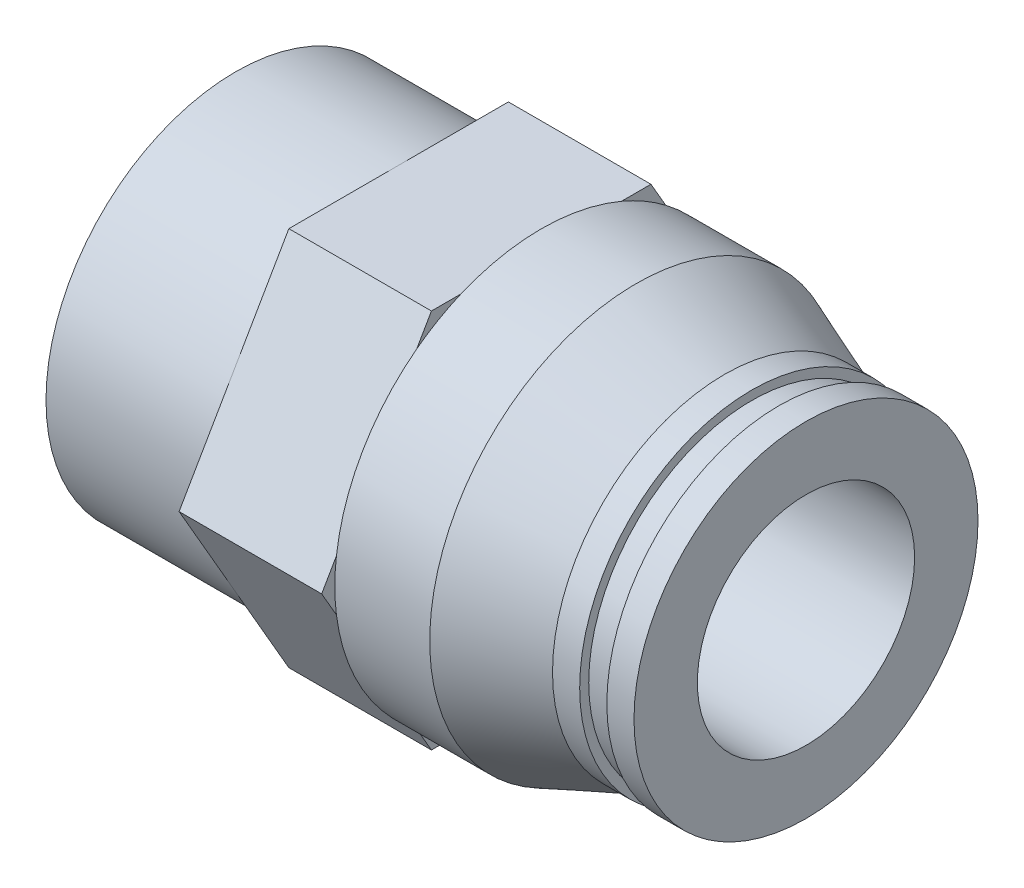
ISO-10303-21;
HEADER;
FILE_DESCRIPTION(('STEP AP214'),'2;1');
FILE_NAME('part.step','',(''),(''),'','','');
FILE_SCHEMA(('AUTOMOTIVE_DESIGN { 1 0 10303 214 1 1 1 1 }'));
ENDSEC;
DATA;
#1=APPLICATION_CONTEXT('core data for automotive mechanical design processes');
#2=APPLICATION_PROTOCOL_DEFINITION('international standard','automotive_design',2000,#1);
#3=PRODUCT_CONTEXT('',#1,'mechanical');
#4=PRODUCT('Part','Part','',(#3));
#5=PRODUCT_RELATED_PRODUCT_CATEGORY('part','',(#4));
#6=PRODUCT_DEFINITION_FORMATION('','',#4);
#7=PRODUCT_DEFINITION_CONTEXT('part definition',#1,'design');
#8=PRODUCT_DEFINITION('design','',#6,#7);
#9=PRODUCT_DEFINITION_SHAPE('','',#8);
#10=(LENGTH_UNIT() NAMED_UNIT(*) SI_UNIT(.MILLI.,.METRE.));
#11=(NAMED_UNIT(*) PLANE_ANGLE_UNIT() SI_UNIT($,.RADIAN.));
#12=(NAMED_UNIT(*) SI_UNIT($,.STERADIAN.) SOLID_ANGLE_UNIT());
#13=UNCERTAINTY_MEASURE_WITH_UNIT(LENGTH_MEASURE(1.E-05),#10,'distance_accuracy_value','');
#14=(GEOMETRIC_REPRESENTATION_CONTEXT(3) GLOBAL_UNCERTAINTY_ASSIGNED_CONTEXT((#13)) GLOBAL_UNIT_ASSIGNED_CONTEXT((#10,
#11,#12)) REPRESENTATION_CONTEXT('',''));
#15=CARTESIAN_POINT('',(0.,0.,0.));
#16=DIRECTION('',(0.,0.,1.));
#17=DIRECTION('',(1.,0.,0.));
#18=AXIS2_PLACEMENT_3D('',#15,#16,#17);
#19=CARTESIAN_POINT('',(9.,10.475,0.));
#20=DIRECTION('',(-1.,0.,0.));
#21=DIRECTION('',(0.,0.,1.));
#22=AXIS2_PLACEMENT_3D('',#19,#20,#21);
#23=PLANE('',#22);
#24=CARTESIAN_POINT('',(9.,0.,0.));
#25=DIRECTION('',(1.,0.,0.));
#26=DIRECTION('',(0.,0.,-1.));
#27=AXIS2_PLACEMENT_3D('',#24,#25,#26);
#28=CIRCLE('',#27,10.475);
#29=CARTESIAN_POINT('',(9.,0.,-10.475));
#30=VERTEX_POINT('',#29);
#31=EDGE_CURVE('E271',#30,#30,#28,.T.);
#32=ORIENTED_EDGE('',*,*,#31,.T.);
#33=EDGE_LOOP('',(#32));
#34=FACE_BOUND('',#33,.T.);
#35=DIRECTION('',(0.,-0.866025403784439,0.5));
#36=VECTOR('',#35,1.);
#37=CARTESIAN_POINT('',(9.,0.,-12.1243556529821));
#38=LINE('',#37,#36);
#39=CARTESIAN_POINT('',(9.,0.,-12.1243556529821));
#40=VERTEX_POINT('',#39);
#41=CARTESIAN_POINT('',(9.,-10.5,-6.06217782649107));
#42=VERTEX_POINT('',#41);
#43=EDGE_CURVE('E165',#40,#42,#38,.T.);
#44=ORIENTED_EDGE('',*,*,#43,.T.);
#45=DIRECTION('',(0.,0.,1.));
#46=VECTOR('',#45,1.);
#47=CARTESIAN_POINT('',(9.,-10.5,-6.06217782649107));
#48=LINE('',#47,#46);
#49=CARTESIAN_POINT('',(9.,-10.5,6.06217782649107));
#50=VERTEX_POINT('',#49);
#51=EDGE_CURVE('E147',#42,#50,#48,.T.);
#52=ORIENTED_EDGE('',*,*,#51,.T.);
#53=DIRECTION('',(0.,0.866025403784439,0.5));
#54=VECTOR('',#53,1.);
#55=CARTESIAN_POINT('',(9.,-10.5,6.06217782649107));
#56=LINE('',#55,#54);
#57=CARTESIAN_POINT('',(9.,0.,12.1243556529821));
#58=VERTEX_POINT('',#57);
#59=EDGE_CURVE('E159',#50,#58,#56,.T.);
#60=ORIENTED_EDGE('',*,*,#59,.T.);
#61=DIRECTION('',(0.,0.866025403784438,-0.5));
#62=VECTOR('',#61,1.);
#63=CARTESIAN_POINT('',(9.,0.,12.1243556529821));
#64=LINE('',#63,#62);
#65=CARTESIAN_POINT('',(9.,10.5,6.06217782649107));
#66=VERTEX_POINT('',#65);
#67=EDGE_CURVE('E31',#58,#66,#64,.T.);
#68=ORIENTED_EDGE('',*,*,#67,.T.);
#69=DIRECTION('',(0.,0.,-1.));
#70=VECTOR('',#69,1.);
#71=CARTESIAN_POINT('',(9.,10.5,6.06217782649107));
#72=LINE('',#71,#70);
#73=CARTESIAN_POINT('',(9.,10.5,-6.06217782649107));
#74=VERTEX_POINT('',#73);
#75=EDGE_CURVE('E169',#66,#74,#72,.T.);
#76=ORIENTED_EDGE('',*,*,#75,.T.);
#77=DIRECTION('',(0.,-0.866025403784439,-0.5));
#78=VECTOR('',#77,1.);
#79=CARTESIAN_POINT('',(9.,10.5,-6.06217782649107));
#80=LINE('',#79,#78);
#81=EDGE_CURVE('E172',#74,#40,#80,.T.);
#82=ORIENTED_EDGE('',*,*,#81,.T.);
#83=EDGE_LOOP('',(#44,#52,#60,#68,#76,#82));
#84=FACE_BOUND('',#83,.T.);
#85=ADVANCED_FACE('F16',(#34,#84),#23,.T.);
#86=CARTESIAN_POINT('',(16.875,12.5,0.));
#87=DIRECTION('',(1.,0.,0.));
#88=DIRECTION('',(0.,0.,-1.));
#89=AXIS2_PLACEMENT_3D('',#86,#87,#88);
#90=PLANE('',#89);
#91=CARTESIAN_POINT('',(16.875,0.,0.));
#92=DIRECTION('',(1.,0.,0.));
#93=DIRECTION('',(0.,0.,-1.));
#94=AXIS2_PLACEMENT_3D('',#91,#92,#93);
#95=CIRCLE('',#94,11.3974316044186);
#96=CARTESIAN_POINT('',(16.875,-10.5,-4.43299528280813));
#97=VERTEX_POINT('',#96);
#98=CARTESIAN_POINT('',(16.875,-9.08908652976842,-6.87676909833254));
#99=VERTEX_POINT('',#98);
#100=EDGE_CURVE('E382',#97,#99,#95,.T.);
#101=ORIENTED_EDGE('',*,*,#100,.F.);
#102=DIRECTION('',(0.,0.,1.));
#103=VECTOR('',#102,1.);
#104=CARTESIAN_POINT('',(16.875,-10.5,-6.06217782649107));
#105=LINE('',#104,#103);
#106=CARTESIAN_POINT('',(16.875,-10.5,-6.06217782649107));
#107=VERTEX_POINT('',#106);
#108=EDGE_CURVE('E175',#107,#97,#105,.T.);
#109=ORIENTED_EDGE('',*,*,#108,.F.);
#110=DIRECTION('',(0.,-0.866025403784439,0.5));
#111=VECTOR('',#110,1.);
#112=CARTESIAN_POINT('',(16.875,0.,-12.1243556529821));
#113=LINE('',#112,#111);
#114=EDGE_CURVE('E195',#99,#107,#113,.T.);
#115=ORIENTED_EDGE('',*,*,#114,.F.);
#116=EDGE_LOOP('',(#101,#109,#115));
#117=FACE_BOUND('',#116,.T.);
#118=ADVANCED_FACE('F326',(#117),#90,.T.);
#119=CARTESIAN_POINT('',(16.875,-1.41091347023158,-11.3097643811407));
#120=VERTEX_POINT('',#119);
#121=CARTESIAN_POINT('',(16.875,1.41091347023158,-11.3097643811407));
#122=VERTEX_POINT('',#121);
#123=EDGE_CURVE('E267',#120,#122,#95,.T.);
#124=ORIENTED_EDGE('',*,*,#123,.F.);
#125=CARTESIAN_POINT('',(16.875,0.,-12.1243556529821));
#126=VERTEX_POINT('',#125);
#127=EDGE_CURVE('E156',#126,#120,#113,.T.);
#128=ORIENTED_EDGE('',*,*,#127,.F.);
#129=DIRECTION('',(0.,-0.866025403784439,-0.5));
#130=VECTOR('',#129,1.);
#131=CARTESIAN_POINT('',(16.875,10.5,-6.06217782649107));
#132=LINE('',#131,#130);
#133=EDGE_CURVE('E190',#122,#126,#132,.T.);
#134=ORIENTED_EDGE('',*,*,#133,.F.);
#135=EDGE_LOOP('',(#124,#128,#134));
#136=FACE_BOUND('',#135,.T.);
#137=ADVANCED_FACE('F332',(#136),#90,.T.);
#138=CARTESIAN_POINT('',(16.875,9.08908652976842,-6.87676909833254));
#139=VERTEX_POINT('',#138);
#140=CARTESIAN_POINT('',(16.875,10.5,-4.43299528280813));
#141=VERTEX_POINT('',#140);
#142=EDGE_CURVE('E272',#139,#141,#95,.T.);
#143=ORIENTED_EDGE('',*,*,#142,.F.);
#144=CARTESIAN_POINT('',(16.875,10.5,-6.06217782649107));
#145=VERTEX_POINT('',#144);
#146=EDGE_CURVE('E192',#145,#139,#132,.T.);
#147=ORIENTED_EDGE('',*,*,#146,.F.);
#148=DIRECTION('',(0.,0.,-1.));
#149=VECTOR('',#148,1.);
#150=CARTESIAN_POINT('',(16.875,10.5,6.06217782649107));
#151=LINE('',#150,#149);
#152=EDGE_CURVE('E185',#141,#145,#151,.T.);
#153=ORIENTED_EDGE('',*,*,#152,.F.);
#154=EDGE_LOOP('',(#143,#147,#153));
#155=FACE_BOUND('',#154,.T.);
#156=ADVANCED_FACE('F444',(#155),#90,.T.);
#157=CARTESIAN_POINT('',(16.875,10.5,4.43299528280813));
#158=VERTEX_POINT('',#157);
#159=CARTESIAN_POINT('',(16.875,9.08908652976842,6.87676909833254));
#160=VERTEX_POINT('',#159);
#161=EDGE_CURVE('E379',#158,#160,#95,.T.);
#162=ORIENTED_EDGE('',*,*,#161,.F.);
#163=CARTESIAN_POINT('',(16.875,10.5,6.06217782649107));
#164=VERTEX_POINT('',#163);
#165=EDGE_CURVE('E187',#164,#158,#151,.T.);
#166=ORIENTED_EDGE('',*,*,#165,.F.);
#167=DIRECTION('',(0.,0.866025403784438,-0.5));
#168=VECTOR('',#167,1.);
#169=CARTESIAN_POINT('',(16.875,0.,12.1243556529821));
#170=LINE('',#169,#168);
#171=EDGE_CURVE('E182',#160,#164,#170,.T.);
#172=ORIENTED_EDGE('',*,*,#171,.F.);
#173=EDGE_LOOP('',(#162,#166,#172));
#174=FACE_BOUND('',#173,.T.);
#175=ADVANCED_FACE('F362',(#174),#90,.T.);
#176=CARTESIAN_POINT('',(16.875,1.41091347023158,11.3097643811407));
#177=VERTEX_POINT('',#176);
#178=CARTESIAN_POINT('',(16.875,-1.41091347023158,11.3097643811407));
#179=VERTEX_POINT('',#178);
#180=EDGE_CURVE('E373',#177,#179,#95,.T.);
#181=ORIENTED_EDGE('',*,*,#180,.F.);
#182=CARTESIAN_POINT('',(16.875,0.,12.1243556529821));
#183=VERTEX_POINT('',#182);
#184=EDGE_CURVE('E37',#183,#177,#170,.T.);
#185=ORIENTED_EDGE('',*,*,#184,.F.);
#186=DIRECTION('',(0.,0.866025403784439,0.5));
#187=VECTOR('',#186,1.);
#188=CARTESIAN_POINT('',(16.875,-10.5,6.06217782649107));
#189=LINE('',#188,#187);
#190=EDGE_CURVE('E178',#179,#183,#189,.T.);
#191=ORIENTED_EDGE('',*,*,#190,.F.);
#192=EDGE_LOOP('',(#181,#185,#191));
#193=FACE_BOUND('',#192,.T.);
#194=ADVANCED_FACE('F357',(#193),#90,.T.);
#195=CARTESIAN_POINT('',(16.875,-10.5,6.06217782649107));
#196=VERTEX_POINT('',#195);
#197=CARTESIAN_POINT('',(16.875,-9.08908652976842,6.87676909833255));
#198=VERTEX_POINT('',#197);
#199=EDGE_CURVE('E180',#196,#198,#189,.T.);
#200=ORIENTED_EDGE('',*,*,#199,.F.);
#201=CARTESIAN_POINT('',(16.875,-10.5,4.43299528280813));
#202=VERTEX_POINT('',#201);
#203=EDGE_CURVE('E151',#202,#196,#105,.T.);
#204=ORIENTED_EDGE('',*,*,#203,.F.);
#205=EDGE_CURVE('E366',#198,#202,#95,.T.);
#206=ORIENTED_EDGE('',*,*,#205,.F.);
#207=EDGE_LOOP('',(#200,#204,#206));
#208=FACE_BOUND('',#207,.T.);
#209=ADVANCED_FACE('F335',(#208),#90,.T.);
#210=CARTESIAN_POINT('',(0.,0.,0.));
#211=DIRECTION('',(-1.,0.,0.));
#212=DIRECTION('',(0.,0.,1.));
#213=AXIS2_PLACEMENT_3D('',#210,#211,#212);
#214=PLANE('',#213);
#215=CARTESIAN_POINT('',(0.,0.,0.));
#216=DIRECTION('',(1.,0.,0.));
#217=DIRECTION('',(0.,0.,-1.));
#218=AXIS2_PLACEMENT_3D('',#215,#216,#217);
#219=CIRCLE('',#218,10.475);
#220=CARTESIAN_POINT('',(0.,0.,-10.475));
#221=VERTEX_POINT('',#220);
#222=EDGE_CURVE('E275',#221,#221,#219,.T.);
#223=ORIENTED_EDGE('',*,*,#222,.F.);
#224=EDGE_LOOP('',(#223));
#225=FACE_BOUND('',#224,.T.);
#226=DIRECTION('',(0.,-0.866025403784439,-0.5));
#227=VECTOR('',#226,1.);
#228=CARTESIAN_POINT('',(0.,0.,4.618802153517));
#229=LINE('',#228,#227);
#230=CARTESIAN_POINT('',(0.,0.,4.618802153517));
#231=VERTEX_POINT('',#230);
#232=CARTESIAN_POINT('',(0.,-4.,2.3094010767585));
#233=VERTEX_POINT('',#232);
#234=EDGE_CURVE('E224',#231,#233,#229,.T.);
#235=ORIENTED_EDGE('',*,*,#234,.T.);
#236=DIRECTION('',(0.,0.,-1.));
#237=VECTOR('',#236,1.);
#238=CARTESIAN_POINT('',(0.,-4.,2.3094010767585));
#239=LINE('',#238,#237);
#240=CARTESIAN_POINT('',(0.,-4.,-2.30940107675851));
#241=VERTEX_POINT('',#240);
#242=EDGE_CURVE('E202',#233,#241,#239,.T.);
#243=ORIENTED_EDGE('',*,*,#242,.T.);
#244=DIRECTION('',(0.,0.866025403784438,-0.5));
#245=VECTOR('',#244,1.);
#246=CARTESIAN_POINT('',(0.,-4.,-2.30940107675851));
#247=LINE('',#246,#245);
#248=CARTESIAN_POINT('',(0.,0.,-4.61880215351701));
#249=VERTEX_POINT('',#248);
#250=EDGE_CURVE('E212',#241,#249,#247,.T.);
#251=ORIENTED_EDGE('',*,*,#250,.T.);
#252=DIRECTION('',(0.,0.866025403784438,0.5));
#253=VECTOR('',#252,1.);
#254=CARTESIAN_POINT('',(0.,0.,-4.61880215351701));
#255=LINE('',#254,#253);
#256=CARTESIAN_POINT('',(0.,4.,-2.3094010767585));
#257=VERTEX_POINT('',#256);
#258=EDGE_CURVE('E215',#249,#257,#255,.T.);
#259=ORIENTED_EDGE('',*,*,#258,.T.);
#260=DIRECTION('',(0.,0.,1.));
#261=VECTOR('',#260,1.);
#262=CARTESIAN_POINT('',(0.,4.,-2.3094010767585));
#263=LINE('',#262,#261);
#264=CARTESIAN_POINT('',(0.,4.,2.3094010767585));
#265=VERTEX_POINT('',#264);
#266=EDGE_CURVE('E218',#257,#265,#263,.T.);
#267=ORIENTED_EDGE('',*,*,#266,.T.);
#268=DIRECTION('',(0.,-0.866025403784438,0.5));
#269=VECTOR('',#268,1.);
#270=CARTESIAN_POINT('',(0.,4.,2.3094010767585));
#271=LINE('',#270,#269);
#272=EDGE_CURVE('E221',#265,#231,#271,.T.);
#273=ORIENTED_EDGE('',*,*,#272,.T.);
#274=EDGE_LOOP('',(#235,#243,#251,#259,#267,#273));
#275=FACE_BOUND('',#274,.T.);
#276=ADVANCED_FACE('F18',(#225,#275),#214,.T.);
#277=CARTESIAN_POINT('',(10.5,6.,0.));
#278=DIRECTION('',(1.,0.,0.));
#279=DIRECTION('',(0.,0.,-1.));
#280=AXIS2_PLACEMENT_3D('',#277,#278,#279);
#281=PLANE('',#280);
#282=CARTESIAN_POINT('',(10.5,0.,0.));
#283=DIRECTION('',(1.,0.,0.));
#284=DIRECTION('',(0.,0.,-1.));
#285=AXIS2_PLACEMENT_3D('',#282,#283,#284);
#286=CIRCLE('',#285,6.);
#287=CARTESIAN_POINT('',(10.5,0.,-6.));
#288=VERTEX_POINT('',#287);
#289=EDGE_CURVE('E240',#288,#288,#286,.T.);
#290=ORIENTED_EDGE('',*,*,#289,.T.);
#291=EDGE_LOOP('',(#290));
#292=FACE_BOUND('',#291,.T.);
#293=DIRECTION('',(0.,-0.866025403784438,0.5));
#294=VECTOR('',#293,1.);
#295=CARTESIAN_POINT('',(10.5,2.5,-6.06217782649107));
#296=LINE('',#295,#294);
#297=CARTESIAN_POINT('',(10.5,0.,-4.61880215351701));
#298=VERTEX_POINT('',#297);
#299=CARTESIAN_POINT('',(10.5,-4.,-2.30940107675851));
#300=VERTEX_POINT('',#299);
#301=EDGE_CURVE('E24',#298,#300,#296,.T.);
#302=ORIENTED_EDGE('',*,*,#301,.T.);
#303=DIRECTION('',(0.,0.,1.));
#304=VECTOR('',#303,1.);
#305=CARTESIAN_POINT('',(10.5,-4.,0.));
#306=LINE('',#305,#304);
#307=CARTESIAN_POINT('',(10.5,-4.,2.3094010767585));
#308=VERTEX_POINT('',#307);
#309=EDGE_CURVE('E10',#300,#308,#306,.T.);
#310=ORIENTED_EDGE('',*,*,#309,.T.);
#311=DIRECTION('',(0.,0.866025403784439,0.5));
#312=VECTOR('',#311,1.);
#313=CARTESIAN_POINT('',(10.5,2.5,6.06217782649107));
#314=LINE('',#313,#312);
#315=CARTESIAN_POINT('',(10.5,0.,4.618802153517));
#316=VERTEX_POINT('',#315);
#317=EDGE_CURVE('E278',#308,#316,#314,.T.);
#318=ORIENTED_EDGE('',*,*,#317,.T.);
#319=DIRECTION('',(0.,0.866025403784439,-0.5));
#320=VECTOR('',#319,1.);
#321=CARTESIAN_POINT('',(10.5,6.5,0.866025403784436));
#322=LINE('',#321,#320);
#323=CARTESIAN_POINT('',(10.5,4.,2.3094010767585));
#324=VERTEX_POINT('',#323);
#325=EDGE_CURVE('E281',#316,#324,#322,.T.);
#326=ORIENTED_EDGE('',*,*,#325,.T.);
#327=DIRECTION('',(0.,0.,-1.));
#328=VECTOR('',#327,1.);
#329=CARTESIAN_POINT('',(10.5,4.,0.));
#330=LINE('',#329,#328);
#331=CARTESIAN_POINT('',(10.5,4.,-2.3094010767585));
#332=VERTEX_POINT('',#331);
#333=EDGE_CURVE('E284',#324,#332,#330,.T.);
#334=ORIENTED_EDGE('',*,*,#333,.T.);
#335=DIRECTION('',(0.,-0.866025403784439,-0.5));
#336=VECTOR('',#335,1.);
#337=CARTESIAN_POINT('',(10.5,6.5,-0.866025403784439));
#338=LINE('',#337,#336);
#339=EDGE_CURVE('E287',#332,#298,#338,.T.);
#340=ORIENTED_EDGE('',*,*,#339,.T.);
#341=EDGE_LOOP('',(#302,#310,#318,#326,#334,#340));
#342=FACE_BOUND('',#341,.T.);
#343=ADVANCED_FACE('F291',(#292,#342),#281,.T.);
#344=CARTESIAN_POINT('',(0.,0.,0.));
#345=DIRECTION('',(1.,0.,0.));
#346=DIRECTION('',(0.,0.,-1.));
#347=AXIS2_PLACEMENT_3D('',#344,#345,#346);
#348=CYLINDRICAL_SURFACE('',#347,10.475);
#349=ORIENTED_EDGE('',*,*,#222,.T.);
#350=EDGE_LOOP('',(#349));
#351=FACE_BOUND('',#350,.T.);
#352=ORIENTED_EDGE('',*,*,#31,.F.);
#353=EDGE_LOOP('',(#352));
#354=FACE_BOUND('',#353,.T.);
#355=ADVANCED_FACE('F337',(#351,#354),#348,.T.);
#356=CARTESIAN_POINT('',(0.,0.,0.));
#357=DIRECTION('',(1.,0.,0.));
#358=DIRECTION('',(0.,0.,-1.));
#359=AXIS2_PLACEMENT_3D('',#356,#357,#358);
#360=CYLINDRICAL_SURFACE('',#359,11.3974316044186);
#361=EDGE_CURVE('E268',#122,#139,#95,.T.);
#362=ORIENTED_EDGE('',*,*,#361,.T.);
#363=ORIENTED_EDGE('',*,*,#142,.T.);
#364=EDGE_CURVE('E446',#141,#158,#95,.T.);
#365=ORIENTED_EDGE('',*,*,#364,.T.);
#366=ORIENTED_EDGE('',*,*,#161,.T.);
#367=EDGE_CURVE('E378',#160,#177,#95,.T.);
#368=ORIENTED_EDGE('',*,*,#367,.T.);
#369=ORIENTED_EDGE('',*,*,#180,.T.);
#370=EDGE_CURVE('E376',#179,#198,#95,.T.);
#371=ORIENTED_EDGE('',*,*,#370,.T.);
#372=ORIENTED_EDGE('',*,*,#205,.T.);
#373=EDGE_CURVE('E380',#202,#97,#95,.T.);
#374=ORIENTED_EDGE('',*,*,#373,.T.);
#375=ORIENTED_EDGE('',*,*,#100,.T.);
#376=EDGE_CURVE('E384',#99,#120,#95,.T.);
#377=ORIENTED_EDGE('',*,*,#376,.T.);
#378=ORIENTED_EDGE('',*,*,#123,.T.);
#379=EDGE_LOOP('',(#362,#363,#365,#366,#368,#369,#371,#372,#374,#375,#377,#378));
#380=FACE_BOUND('',#379,.T.);
#381=CARTESIAN_POINT('',(22.1152899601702,0.,0.));
#382=DIRECTION('',(1.,0.,0.));
#383=DIRECTION('',(0.,0.,-1.));
#384=AXIS2_PLACEMENT_3D('',#381,#382,#383);
#385=CIRCLE('',#384,11.3974316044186);
#386=CARTESIAN_POINT('',(22.1152899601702,0.,-11.3974316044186));
#387=VERTEX_POINT('',#386);
#388=EDGE_CURVE('E264',#387,#387,#385,.T.);
#389=ORIENTED_EDGE('',*,*,#388,.F.);
#390=EDGE_LOOP('',(#389));
#391=FACE_BOUND('',#390,.T.);
#392=ADVANCED_FACE('F339',(#380,#391),#360,.T.);
#393=CARTESIAN_POINT('',(27.,0.,0.));
#394=DIRECTION('',(-1.,0.,0.));
#395=DIRECTION('',(0.,0.,1.));
#396=AXIS2_PLACEMENT_3D('',#393,#394,#395);
#397=CONICAL_SURFACE('',#396,9.5,0.370503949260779);
#398=ORIENTED_EDGE('',*,*,#388,.T.);
#399=EDGE_LOOP('',(#398));
#400=FACE_BOUND('',#399,.T.);
#401=CARTESIAN_POINT('',(27.,0.,0.));
#402=DIRECTION('',(1.,0.,0.));
#403=DIRECTION('',(0.,0.,-1.));
#404=AXIS2_PLACEMENT_3D('',#401,#402,#403);
#405=CIRCLE('',#404,9.5);
#406=CARTESIAN_POINT('',(27.,0.,-9.5));
#407=VERTEX_POINT('',#406);
#408=EDGE_CURVE('E261',#407,#407,#405,.T.);
#409=ORIENTED_EDGE('',*,*,#408,.F.);
#410=EDGE_LOOP('',(#409));
#411=FACE_BOUND('',#410,.T.);
#412=ADVANCED_FACE('F345',(#400,#411),#397,.T.);
#413=CARTESIAN_POINT('',(0.,0.,0.));
#414=DIRECTION('',(1.,0.,0.));
#415=DIRECTION('',(0.,0.,-1.));
#416=AXIS2_PLACEMENT_3D('',#413,#414,#415);
#417=CYLINDRICAL_SURFACE('',#416,9.5);
#418=ORIENTED_EDGE('',*,*,#408,.T.);
#419=EDGE_LOOP('',(#418));
#420=FACE_BOUND('',#419,.T.);
#421=CARTESIAN_POINT('',(28.5,0.,0.));
#422=DIRECTION('',(1.,0.,0.));
#423=DIRECTION('',(0.,0.,-1.));
#424=AXIS2_PLACEMENT_3D('',#421,#422,#423);
#425=CIRCLE('',#424,9.5);
#426=CARTESIAN_POINT('',(28.5,0.,-9.5));
#427=VERTEX_POINT('',#426);
#428=EDGE_CURVE('E258',#427,#427,#425,.T.);
#429=ORIENTED_EDGE('',*,*,#428,.F.);
#430=EDGE_LOOP('',(#429));
#431=FACE_BOUND('',#430,.T.);
#432=ADVANCED_FACE('F607',(#420,#431),#417,.T.);
#433=CARTESIAN_POINT('',(28.5,9.5,0.));
#434=DIRECTION('',(1.,0.,0.));
#435=DIRECTION('',(0.,0.,-1.));
#436=AXIS2_PLACEMENT_3D('',#433,#434,#435);
#437=PLANE('',#436);
#438=ORIENTED_EDGE('',*,*,#428,.T.);
#439=EDGE_LOOP('',(#438));
#440=FACE_BOUND('',#439,.T.);
#441=CARTESIAN_POINT('',(28.5,0.,0.));
#442=DIRECTION('',(1.,0.,0.));
#443=DIRECTION('',(0.,0.,-1.));
#444=AXIS2_PLACEMENT_3D('',#441,#442,#443);
#445=CIRCLE('',#444,9.);
#446=CARTESIAN_POINT('',(28.5,0.,-9.));
#447=VERTEX_POINT('',#446);
#448=EDGE_CURVE('E255',#447,#447,#445,.T.);
#449=ORIENTED_EDGE('',*,*,#448,.F.);
#450=EDGE_LOOP('',(#449));
#451=FACE_BOUND('',#450,.T.);
#452=ADVANCED_FACE('F597',(#440,#451),#437,.T.);
#453=CARTESIAN_POINT('',(0.,0.,0.));
#454=DIRECTION('',(1.,0.,0.));
#455=DIRECTION('',(0.,0.,-1.));
#456=AXIS2_PLACEMENT_3D('',#453,#454,#455);
#457=CYLINDRICAL_SURFACE('',#456,9.);
#458=ORIENTED_EDGE('',*,*,#448,.T.);
#459=EDGE_LOOP('',(#458));
#460=FACE_BOUND('',#459,.T.);
#461=CARTESIAN_POINT('',(30.,0.,0.));
#462=DIRECTION('',(1.,0.,0.));
#463=DIRECTION('',(0.,0.,-1.));
#464=AXIS2_PLACEMENT_3D('',#461,#462,#463);
#465=CIRCLE('',#464,9.);
#466=CARTESIAN_POINT('',(30.,0.,-9.));
#467=VERTEX_POINT('',#466);
#468=EDGE_CURVE('E252',#467,#467,#465,.T.);
#469=ORIENTED_EDGE('',*,*,#468,.F.);
#470=EDGE_LOOP('',(#469));
#471=FACE_BOUND('',#470,.T.);
#472=ADVANCED_FACE('F587',(#460,#471),#457,.T.);
#473=CARTESIAN_POINT('',(30.,9.,0.));
#474=DIRECTION('',(-1.,0.,0.));
#475=DIRECTION('',(0.,0.,1.));
#476=AXIS2_PLACEMENT_3D('',#473,#474,#475);
#477=PLANE('',#476);
#478=ORIENTED_EDGE('',*,*,#468,.T.);
#479=EDGE_LOOP('',(#478));
#480=FACE_BOUND('',#479,.T.);
#481=CARTESIAN_POINT('',(30.,0.,0.));
#482=DIRECTION('',(1.,0.,0.));
#483=DIRECTION('',(0.,0.,-1.));
#484=AXIS2_PLACEMENT_3D('',#481,#482,#483);
#485=CIRCLE('',#484,9.5);
#486=CARTESIAN_POINT('',(30.,0.,-9.5));
#487=VERTEX_POINT('',#486);
#488=EDGE_CURVE('E249',#487,#487,#485,.T.);
#489=ORIENTED_EDGE('',*,*,#488,.F.);
#490=EDGE_LOOP('',(#489));
#491=FACE_BOUND('',#490,.T.);
#492=ADVANCED_FACE('F577',(#480,#491),#477,.T.);
#493=CARTESIAN_POINT('',(0.,0.,0.));
#494=DIRECTION('',(1.,0.,0.));
#495=DIRECTION('',(0.,0.,-1.));
#496=AXIS2_PLACEMENT_3D('',#493,#494,#495);
#497=CYLINDRICAL_SURFACE('',#496,9.5);
#498=ORIENTED_EDGE('',*,*,#488,.T.);
#499=EDGE_LOOP('',(#498));
#500=FACE_BOUND('',#499,.T.);
#501=CARTESIAN_POINT('',(31.5,0.,0.));
#502=DIRECTION('',(1.,0.,0.));
#503=DIRECTION('',(0.,0.,-1.));
#504=AXIS2_PLACEMENT_3D('',#501,#502,#503);
#505=CIRCLE('',#504,9.5);
#506=CARTESIAN_POINT('',(31.5,0.,-9.5));
#507=VERTEX_POINT('',#506);
#508=EDGE_CURVE('E246',#507,#507,#505,.T.);
#509=ORIENTED_EDGE('',*,*,#508,.F.);
#510=EDGE_LOOP('',(#509));
#511=FACE_BOUND('',#510,.T.);
#512=ADVANCED_FACE('F566',(#500,#511),#497,.T.);
#513=CARTESIAN_POINT('',(31.5,9.5,0.));
#514=DIRECTION('',(1.,0.,0.));
#515=DIRECTION('',(0.,0.,-1.));
#516=AXIS2_PLACEMENT_3D('',#513,#514,#515);
#517=PLANE('',#516);
#518=ORIENTED_EDGE('',*,*,#508,.T.);
#519=EDGE_LOOP('',(#518));
#520=FACE_BOUND('',#519,.T.);
#521=CARTESIAN_POINT('',(31.5,0.,0.));
#522=DIRECTION('',(1.,0.,0.));
#523=DIRECTION('',(0.,0.,-1.));
#524=AXIS2_PLACEMENT_3D('',#521,#522,#523);
#525=CIRCLE('',#524,6.);
#526=CARTESIAN_POINT('',(31.5,0.,-6.));
#527=VERTEX_POINT('',#526);
#528=EDGE_CURVE('E243',#527,#527,#525,.T.);
#529=ORIENTED_EDGE('',*,*,#528,.F.);
#530=EDGE_LOOP('',(#529));
#531=FACE_BOUND('',#530,.T.);
#532=ADVANCED_FACE('F552',(#520,#531),#517,.T.);
#533=CARTESIAN_POINT('',(0.,0.,0.));
#534=DIRECTION('',(1.,0.,0.));
#535=DIRECTION('',(0.,0.,-1.));
#536=AXIS2_PLACEMENT_3D('',#533,#534,#535);
#537=CYLINDRICAL_SURFACE('',#536,6.);
#538=ORIENTED_EDGE('',*,*,#528,.T.);
#539=EDGE_LOOP('',(#538));
#540=FACE_BOUND('',#539,.T.);
#541=ORIENTED_EDGE('',*,*,#289,.F.);
#542=EDGE_LOOP('',(#541));
#543=FACE_BOUND('',#542,.T.);
#544=ADVANCED_FACE('F542',(#540,#543),#537,.F.);
#545=CARTESIAN_POINT('',(31.5,-4.,2.3094010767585));
#546=DIRECTION('',(0.,1.,0.));
#547=DIRECTION('',(0.,0.,1.));
#548=AXIS2_PLACEMENT_3D('',#545,#546,#547);
#549=PLANE('',#548);
#550=DIRECTION('',(-1.,0.,0.));
#551=VECTOR('',#550,1.);
#552=CARTESIAN_POINT('',(31.5,-4.,-2.30940107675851));
#553=LINE('',#552,#551);
#554=EDGE_CURVE('E238',#300,#241,#553,.T.);
#555=ORIENTED_EDGE('',*,*,#554,.T.);
#556=ORIENTED_EDGE('',*,*,#242,.F.);
#557=DIRECTION('',(-1.,0.,0.));
#558=VECTOR('',#557,1.);
#559=CARTESIAN_POINT('',(31.5,-4.,2.3094010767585));
#560=LINE('',#559,#558);
#561=EDGE_CURVE('E227',#308,#233,#560,.T.);
#562=ORIENTED_EDGE('',*,*,#561,.F.);
#563=ORIENTED_EDGE('',*,*,#309,.F.);
#564=EDGE_LOOP('',(#555,#556,#562,#563));
#565=FACE_BOUND('',#564,.T.);
#566=ADVANCED_FACE('F306',(#565),#549,.T.);
#567=CARTESIAN_POINT('',(31.5,-4.,-2.30940107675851));
#568=DIRECTION('',(0.,0.5,0.866025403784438));
#569=DIRECTION('',(0.,-0.866025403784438,0.5));
#570=AXIS2_PLACEMENT_3D('',#567,#568,#569);
#571=PLANE('',#570);
#572=DIRECTION('',(-1.,0.,0.));
#573=VECTOR('',#572,1.);
#574=CARTESIAN_POINT('',(31.5,0.,-4.61880215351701));
#575=LINE('',#574,#573);
#576=EDGE_CURVE('E236',#298,#249,#575,.T.);
#577=ORIENTED_EDGE('',*,*,#576,.T.);
#578=ORIENTED_EDGE('',*,*,#250,.F.);
#579=ORIENTED_EDGE('',*,*,#554,.F.);
#580=ORIENTED_EDGE('',*,*,#301,.F.);
#581=EDGE_LOOP('',(#577,#578,#579,#580));
#582=FACE_BOUND('',#581,.T.);
#583=ADVANCED_FACE('F295',(#582),#571,.T.);
#584=CARTESIAN_POINT('',(31.5,0.,-4.61880215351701));
#585=DIRECTION('',(0.,-0.5,0.866025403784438));
#586=DIRECTION('',(0.,-0.866025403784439,-0.5));
#587=AXIS2_PLACEMENT_3D('',#584,#585,#586);
#588=PLANE('',#587);
#589=DIRECTION('',(-1.,0.,0.));
#590=VECTOR('',#589,1.);
#591=CARTESIAN_POINT('',(31.5,4.,-2.3094010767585));
#592=LINE('',#591,#590);
#593=EDGE_CURVE('E234',#332,#257,#592,.T.);
#594=ORIENTED_EDGE('',*,*,#593,.T.);
#595=ORIENTED_EDGE('',*,*,#258,.F.);
#596=ORIENTED_EDGE('',*,*,#576,.F.);
#597=ORIENTED_EDGE('',*,*,#339,.F.);
#598=EDGE_LOOP('',(#594,#595,#596,#597));
#599=FACE_BOUND('',#598,.T.);
#600=ADVANCED_FACE('F299',(#599),#588,.T.);
#601=CARTESIAN_POINT('',(31.5,4.,-2.3094010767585));
#602=DIRECTION('',(0.,-1.,0.));
#603=DIRECTION('',(0.,0.,-1.));
#604=AXIS2_PLACEMENT_3D('',#601,#602,#603);
#605=PLANE('',#604);
#606=DIRECTION('',(-1.,0.,0.));
#607=VECTOR('',#606,1.);
#608=CARTESIAN_POINT('',(31.5,4.,2.3094010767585));
#609=LINE('',#608,#607);
#610=EDGE_CURVE('E232',#324,#265,#609,.T.);
#611=ORIENTED_EDGE('',*,*,#610,.T.);
#612=ORIENTED_EDGE('',*,*,#266,.F.);
#613=ORIENTED_EDGE('',*,*,#593,.F.);
#614=ORIENTED_EDGE('',*,*,#333,.F.);
#615=EDGE_LOOP('',(#611,#612,#613,#614));
#616=FACE_BOUND('',#615,.T.);
#617=ADVANCED_FACE('F315',(#616),#605,.T.);
#618=CARTESIAN_POINT('',(31.5,4.,2.3094010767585));
#619=DIRECTION('',(0.,-0.5,-0.866025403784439));
#620=DIRECTION('',(0.,0.866025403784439,-0.5));
#621=AXIS2_PLACEMENT_3D('',#618,#619,#620);
#622=PLANE('',#621);
#623=DIRECTION('',(-1.,0.,0.));
#624=VECTOR('',#623,1.);
#625=CARTESIAN_POINT('',(31.5,0.,4.618802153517));
#626=LINE('',#625,#624);
#627=EDGE_CURVE('E230',#316,#231,#626,.T.);
#628=ORIENTED_EDGE('',*,*,#627,.T.);
#629=ORIENTED_EDGE('',*,*,#272,.F.);
#630=ORIENTED_EDGE('',*,*,#610,.F.);
#631=ORIENTED_EDGE('',*,*,#325,.F.);
#632=EDGE_LOOP('',(#628,#629,#630,#631));
#633=FACE_BOUND('',#632,.T.);
#634=ADVANCED_FACE('F312',(#633),#622,.T.);
#635=CARTESIAN_POINT('',(31.5,0.,4.618802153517));
#636=DIRECTION('',(0.,0.5,-0.866025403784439));
#637=DIRECTION('',(0.,0.866025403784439,0.5));
#638=AXIS2_PLACEMENT_3D('',#635,#636,#637);
#639=PLANE('',#638);
#640=ORIENTED_EDGE('',*,*,#561,.T.);
#641=ORIENTED_EDGE('',*,*,#234,.F.);
#642=ORIENTED_EDGE('',*,*,#627,.F.);
#643=ORIENTED_EDGE('',*,*,#317,.F.);
#644=EDGE_LOOP('',(#640,#641,#642,#643));
#645=FACE_BOUND('',#644,.T.);
#646=ADVANCED_FACE('F308',(#645),#639,.T.);
#647=CARTESIAN_POINT('',(16.875,0.,0.));
#648=DIRECTION('',(-1.,0.,0.));
#649=DIRECTION('',(0.,0.,1.));
#650=AXIS2_PLACEMENT_3D('',#647,#648,#649);
#651=PLANE('',#650);
#652=EDGE_CURVE('E183',#198,#179,#189,.T.);
#653=ORIENTED_EDGE('',*,*,#652,.F.);
#654=ORIENTED_EDGE('',*,*,#370,.F.);
#655=EDGE_LOOP('',(#653,#654));
#656=FACE_BOUND('',#655,.T.);
#657=ADVANCED_FACE('F418',(#656),#651,.T.);
#658=EDGE_CURVE('E179',#97,#202,#105,.T.);
#659=ORIENTED_EDGE('',*,*,#658,.F.);
#660=ORIENTED_EDGE('',*,*,#373,.F.);
#661=EDGE_LOOP('',(#659,#660));
#662=FACE_BOUND('',#661,.T.);
#663=ADVANCED_FACE('F412',(#662),#651,.T.);
#664=EDGE_CURVE('E199',#120,#99,#113,.T.);
#665=ORIENTED_EDGE('',*,*,#664,.F.);
#666=ORIENTED_EDGE('',*,*,#376,.F.);
#667=EDGE_LOOP('',(#665,#666));
#668=FACE_BOUND('',#667,.T.);
#669=ADVANCED_FACE('F404',(#668),#651,.T.);
#670=EDGE_CURVE('E196',#139,#122,#132,.T.);
#671=ORIENTED_EDGE('',*,*,#670,.F.);
#672=ORIENTED_EDGE('',*,*,#361,.F.);
#673=EDGE_LOOP('',(#671,#672));
#674=FACE_BOUND('',#673,.T.);
#675=ADVANCED_FACE('F401',(#674),#651,.T.);
#676=EDGE_CURVE('E191',#158,#141,#151,.T.);
#677=ORIENTED_EDGE('',*,*,#676,.F.);
#678=ORIENTED_EDGE('',*,*,#364,.F.);
#679=EDGE_LOOP('',(#677,#678));
#680=FACE_BOUND('',#679,.T.);
#681=ADVANCED_FACE('F403',(#680),#651,.T.);
#682=EDGE_CURVE('E186',#177,#160,#170,.T.);
#683=ORIENTED_EDGE('',*,*,#682,.F.);
#684=ORIENTED_EDGE('',*,*,#367,.F.);
#685=EDGE_LOOP('',(#683,#684));
#686=FACE_BOUND('',#685,.T.);
#687=ADVANCED_FACE('F410',(#686),#651,.T.);
#688=CARTESIAN_POINT('',(16.875,-10.5,-6.06217782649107));
#689=DIRECTION('',(0.,-1.,0.));
#690=DIRECTION('',(0.,0.,-1.));
#691=AXIS2_PLACEMENT_3D('',#688,#689,#690);
#692=PLANE('',#691);
#693=DIRECTION('',(-1.,0.,0.));
#694=VECTOR('',#693,1.);
#695=CARTESIAN_POINT('',(16.875,-10.5,-6.06217782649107));
#696=LINE('',#695,#694);
#697=EDGE_CURVE('E200',#107,#42,#696,.T.);
#698=ORIENTED_EDGE('',*,*,#697,.F.);
#699=ORIENTED_EDGE('',*,*,#108,.T.);
#700=ORIENTED_EDGE('',*,*,#658,.T.);
#701=ORIENTED_EDGE('',*,*,#203,.T.);
#702=DIRECTION('',(-1.,0.,0.));
#703=VECTOR('',#702,1.);
#704=CARTESIAN_POINT('',(16.875,-10.5,6.06217782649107));
#705=LINE('',#704,#703);
#706=EDGE_CURVE('E142',#196,#50,#705,.T.);
#707=ORIENTED_EDGE('',*,*,#706,.T.);
#708=ORIENTED_EDGE('',*,*,#51,.F.);
#709=EDGE_LOOP('',(#698,#699,#700,#701,#707,#708));
#710=FACE_BOUND('',#709,.T.);
#711=ADVANCED_FACE('F145',(#710),#692,.T.);
#712=CARTESIAN_POINT('',(16.875,0.,-12.1243556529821));
#713=DIRECTION('',(0.,-0.5,-0.866025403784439));
#714=DIRECTION('',(0.,0.866025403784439,-0.5));
#715=AXIS2_PLACEMENT_3D('',#712,#713,#714);
#716=PLANE('',#715);
#717=DIRECTION('',(-1.,0.,0.));
#718=VECTOR('',#717,1.);
#719=CARTESIAN_POINT('',(16.875,0.,-12.1243556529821));
#720=LINE('',#719,#718);
#721=EDGE_CURVE('E203',#126,#40,#720,.T.);
#722=ORIENTED_EDGE('',*,*,#721,.F.);
#723=ORIENTED_EDGE('',*,*,#127,.T.);
#724=ORIENTED_EDGE('',*,*,#664,.T.);
#725=ORIENTED_EDGE('',*,*,#114,.T.);
#726=ORIENTED_EDGE('',*,*,#697,.T.);
#727=ORIENTED_EDGE('',*,*,#43,.F.);
#728=EDGE_LOOP('',(#722,#723,#724,#725,#726,#727));
#729=FACE_BOUND('',#728,.T.);
#730=ADVANCED_FACE('F434',(#729),#716,.T.);
#731=CARTESIAN_POINT('',(16.875,10.5,-6.06217782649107));
#732=DIRECTION('',(0.,0.5,-0.866025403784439));
#733=DIRECTION('',(0.,0.866025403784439,0.5));
#734=AXIS2_PLACEMENT_3D('',#731,#732,#733);
#735=PLANE('',#734);
#736=DIRECTION('',(-1.,0.,0.));
#737=VECTOR('',#736,1.);
#738=CARTESIAN_POINT('',(16.875,10.5,-6.06217782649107));
#739=LINE('',#738,#737);
#740=EDGE_CURVE('E205',#145,#74,#739,.T.);
#741=ORIENTED_EDGE('',*,*,#740,.F.);
#742=ORIENTED_EDGE('',*,*,#146,.T.);
#743=ORIENTED_EDGE('',*,*,#670,.T.);
#744=ORIENTED_EDGE('',*,*,#133,.T.);
#745=ORIENTED_EDGE('',*,*,#721,.T.);
#746=ORIENTED_EDGE('',*,*,#81,.F.);
#747=EDGE_LOOP('',(#741,#742,#743,#744,#745,#746));
#748=FACE_BOUND('',#747,.T.);
#749=ADVANCED_FACE('F397',(#748),#735,.T.);
#750=CARTESIAN_POINT('',(16.875,10.5,6.06217782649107));
#751=DIRECTION('',(0.,1.,0.));
#752=DIRECTION('',(0.,0.,1.));
#753=AXIS2_PLACEMENT_3D('',#750,#751,#752);
#754=PLANE('',#753);
#755=DIRECTION('',(-1.,0.,0.));
#756=VECTOR('',#755,1.);
#757=CARTESIAN_POINT('',(16.875,10.5,6.06217782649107));
#758=LINE('',#757,#756);
#759=EDGE_CURVE('E207',#164,#66,#758,.T.);
#760=ORIENTED_EDGE('',*,*,#759,.F.);
#761=ORIENTED_EDGE('',*,*,#165,.T.);
#762=ORIENTED_EDGE('',*,*,#676,.T.);
#763=ORIENTED_EDGE('',*,*,#152,.T.);
#764=ORIENTED_EDGE('',*,*,#740,.T.);
#765=ORIENTED_EDGE('',*,*,#75,.F.);
#766=EDGE_LOOP('',(#760,#761,#762,#763,#764,#765));
#767=FACE_BOUND('',#766,.T.);
#768=ADVANCED_FACE('F439',(#767),#754,.T.);
#769=CARTESIAN_POINT('',(16.875,0.,12.1243556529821));
#770=DIRECTION('',(0.,0.5,0.866025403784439));
#771=DIRECTION('',(0.,-0.866025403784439,0.5));
#772=AXIS2_PLACEMENT_3D('',#769,#770,#771);
#773=PLANE('',#772);
#774=DIRECTION('',(-1.,0.,0.));
#775=VECTOR('',#774,1.);
#776=CARTESIAN_POINT('',(16.875,0.,12.1243556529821));
#777=LINE('',#776,#775);
#778=EDGE_CURVE('E155',#183,#58,#777,.T.);
#779=ORIENTED_EDGE('',*,*,#778,.F.);
#780=ORIENTED_EDGE('',*,*,#184,.T.);
#781=ORIENTED_EDGE('',*,*,#682,.T.);
#782=ORIENTED_EDGE('',*,*,#171,.T.);
#783=ORIENTED_EDGE('',*,*,#759,.T.);
#784=ORIENTED_EDGE('',*,*,#67,.F.);
#785=EDGE_LOOP('',(#779,#780,#781,#782,#783,#784));
#786=FACE_BOUND('',#785,.T.);
#787=ADVANCED_FACE('F450',(#786),#773,.T.);
#788=CARTESIAN_POINT('',(16.875,-10.5,6.06217782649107));
#789=DIRECTION('',(0.,-0.5,0.866025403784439));
#790=DIRECTION('',(0.,-0.866025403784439,-0.5));
#791=AXIS2_PLACEMENT_3D('',#788,#789,#790);
#792=PLANE('',#791);
#793=ORIENTED_EDGE('',*,*,#706,.F.);
#794=ORIENTED_EDGE('',*,*,#199,.T.);
#795=ORIENTED_EDGE('',*,*,#652,.T.);
#796=ORIENTED_EDGE('',*,*,#190,.T.);
#797=ORIENTED_EDGE('',*,*,#778,.T.);
#798=ORIENTED_EDGE('',*,*,#59,.F.);
#799=EDGE_LOOP('',(#793,#794,#795,#796,#797,#798));
#800=FACE_BOUND('',#799,.T.);
#801=ADVANCED_FACE('F160',(#800),#792,.T.);
#802=CLOSED_SHELL('',(#85,#118,#137,#156,#175,#194,#209,#276,#343,#355,#392,#412,#432,#452,#472,
#492,#512,#532,#544,#566,#583,#600,#617,#634,#646,#657,#663,#669,#675,#681,#687,#711,#730,#749,
#768,#787,#801));
#803=MANIFOLD_SOLID_BREP('B1',#802);
#804=ADVANCED_BREP_SHAPE_REPRESENTATION('',(#18,#803),#14);
#805=SHAPE_DEFINITION_REPRESENTATION(#9,#804);
ENDSEC;
END-ISO-10303-21;
